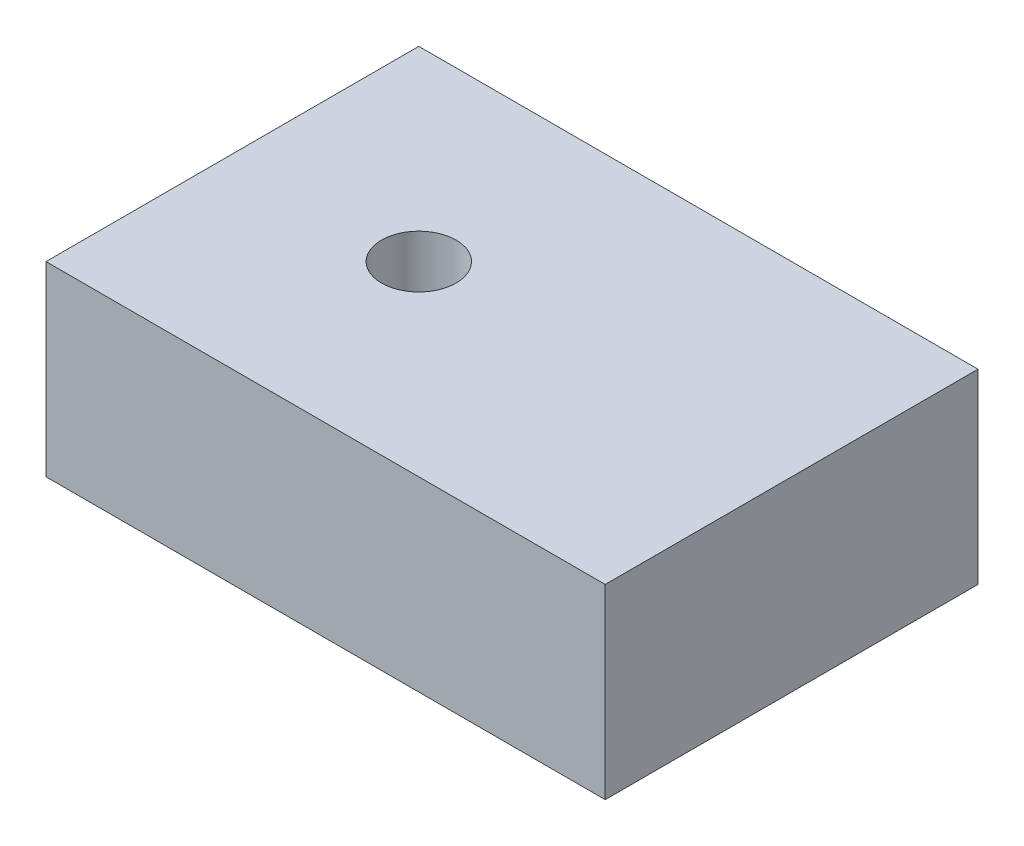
from build123d import *

# Parameters (mm, degrees)
SKIZZE1_W                       = 30
SKIZZE1_H                       = 20
LINEAR_AUSTRAGEN1_DEPTH         = 10
SKIZZE2_R                       = 2
SCHNITT_LINEAR_AUSTRAGEN1_DEPTH = 38.416573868


with BuildPart() as part:
    # Skizze1 → Linear austragen1 (new body)
    with BuildSketch(Plane(origin=(0, 0, 0), x_dir=(1, 0, 0), z_dir=(0, 1, 0))):
        with Locations((-15, 10)):
            Rectangle(SKIZZE1_W, SKIZZE1_H)
    extrude(amount=LINEAR_AUSTRAGEN1_DEPTH)

    # Skizze2 → Schnitt-Linear austragen1 (cut, through all)
    with BuildSketch(Plane(origin=(0, 10, 0), x_dir=(1, 0, 0), z_dir=(0, 1, 0))):
        with Locations(Location((-20, 10, 0), (0, 0, 270))):
            Circle(SKIZZE2_R)
    extrude(amount=-SCHNITT_LINEAR_AUSTRAGEN1_DEPTH, mode=Mode.SUBTRACT)


solid = part.part
